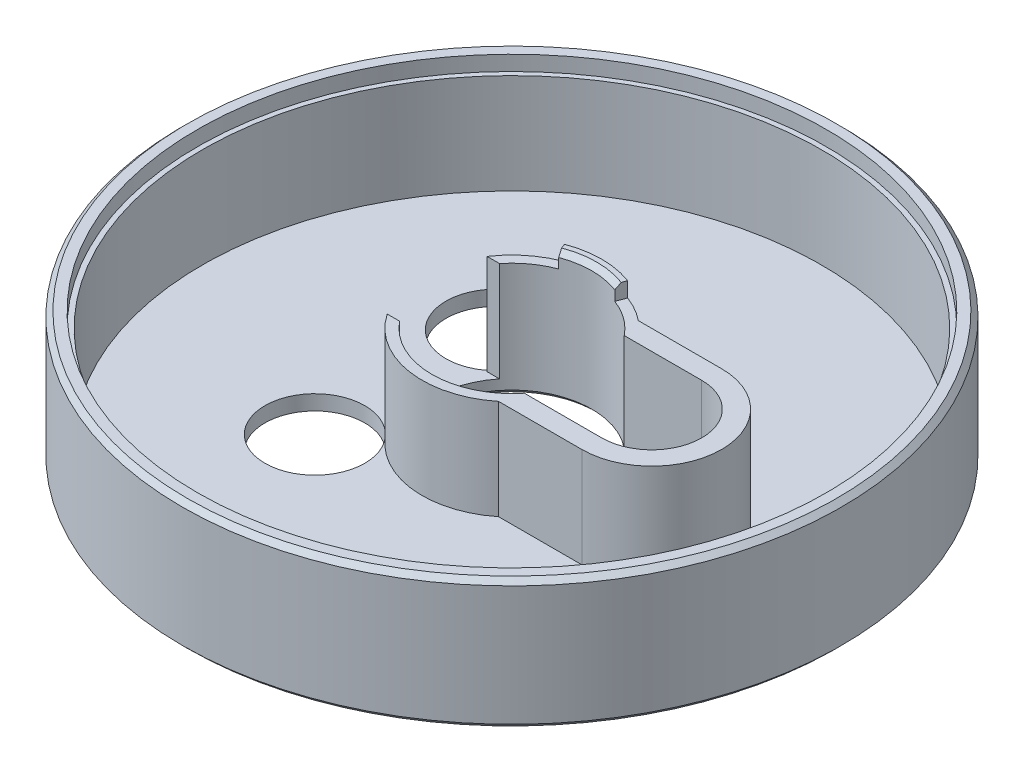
from build123d import *

# Parameters (mm, degrees)
SKETCH1_R           = 33
SKETCH1_R_2         = 8
BOSS_EXTRUDE1_DEPTH = 13
SKETCH2_R           = 31.5
CUT_EXTRUDE1_DEPTH  = 1.5
CHAMFER1_SIZE       = 0.5
CUT_EXTRUDE2_DEPTH  = 10
SKETCH4_R           = 31
CUT_EXTRUDE3_DEPTH  = 10
SKETCH5_R           = 5
CUT_EXTRUDE4_DEPTH  = 49.065060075


with BuildPart() as part:
    # Sketch1 → Boss-Extrude1 (new body)
    with BuildSketch(Plane(origin=(0, 0, 0), x_dir=(1, 0, 0), z_dir=(0, 1, 0))):
        with Locations(Location((0, 0, 0), (0, 0, 270))):
            Circle(SKETCH1_R)
        with Locations(Location((0, 0, 0), (0, 0, 270))):
            Circle(SKETCH1_R_2, mode=Mode.SUBTRACT)
    extrude(amount=-BOSS_EXTRUDE1_DEPTH)

    # Sketch2 → Cut-Extrude1 (cut)
    with BuildSketch(Plane(origin=(0, 0, 0), x_dir=(1, 0, 0), z_dir=(0, 1, 0))):
        with Locations(Location((0, 0, 0), (0, 0, 270))):
            Circle(SKETCH2_R)
        with BuildLine():
            Line((2.808987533, 7.490633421), (3, 8))
            Line((3, 8), (3.160110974, 8.426962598))
            ThreePointArc((3.160110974, 8.426962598), (0, 9), (-3.160110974, 8.426962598))
            Line((-3.160110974, 8.426962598), (-3, 8))
            Line((-3, 8), (-2.808987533, 7.490633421))
            ThreePointArc((-2.808987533, 7.490633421), (0, -8), (2.808987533, 7.490633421))
        make_face(mode=Mode.SUBTRACT)
    extrude(amount=-CUT_EXTRUDE1_DEPTH, mode=Mode.SUBTRACT)

    # Chamfer1
    chamfer1_edges = [part.edges().sort_by_distance(p)[0] for p in [
        (0, 0, -33),
        (0, -13, -33),
        (0, -13, -8),
        (0, 0, -8),
    ]]
    chamfer(chamfer1_edges, length=CHAMFER1_SIZE)

    # Sketch3 → Cut-Extrude2 (cut)
    with BuildSketch(Plane(origin=(0, -1.5, 0), x_dir=(1, 0, 0), z_dir=(0, 1, 0))):
        with BuildLine():
            Line((14, 5), (-7.483314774, 5))
            ThreePointArc((-7.483314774, 5), (-9, 0), (-7.483314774, -5))
            Line((-7.483314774, -5), (14, -5))
            ThreePointArc((14, -5), (19, 0), (14, 5))
        make_face()
    extrude(amount=-CUT_EXTRUDE2_DEPTH, mode=Mode.SUBTRACT)

    # Sketch4 → Cut-Extrude3 (cut)
    with BuildSketch(Plane(origin=(0, -1.5, 0), x_dir=(1, 0, 0), z_dir=(0, 1, 0))):
        with Locations(Location((0, 0, 0), (0, 0, 270))):
            Circle(SKETCH4_R)
        with BuildLine():
            Line((14, 7), (5.656854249, 7))
            ThreePointArc((5.656854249, 7), (-9, 0), (5.656854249, -7))
            Line((5.656854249, -7), (14, -7))
            ThreePointArc((14, -7), (21, 0), (14, 7))
        make_face(mode=Mode.SUBTRACT)
    extrude(amount=-CUT_EXTRUDE3_DEPTH, mode=Mode.SUBTRACT)

    # Sketch5 → Cut-Extrude4 (cut, through all)
    with BuildSketch(Plane(origin=(0, -11.5, 0), x_dir=(1, 0, 0), z_dir=(0, 1, 0))):
        with Locations(Location((26, 0, 0), (0, 0, 270))):
            Circle(SKETCH5_R)
        with Locations(Location((-10.66929038, 9.064559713, 0), (0, 0, 270))):
            Circle(SKETCH5_R)
        with Locations(Location((-10.66929038, -9.064559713, 0), (0, 0, 270))):
            Circle(SKETCH5_R)
    extrude(amount=-CUT_EXTRUDE4_DEPTH, mode=Mode.SUBTRACT)


solid = part.part
